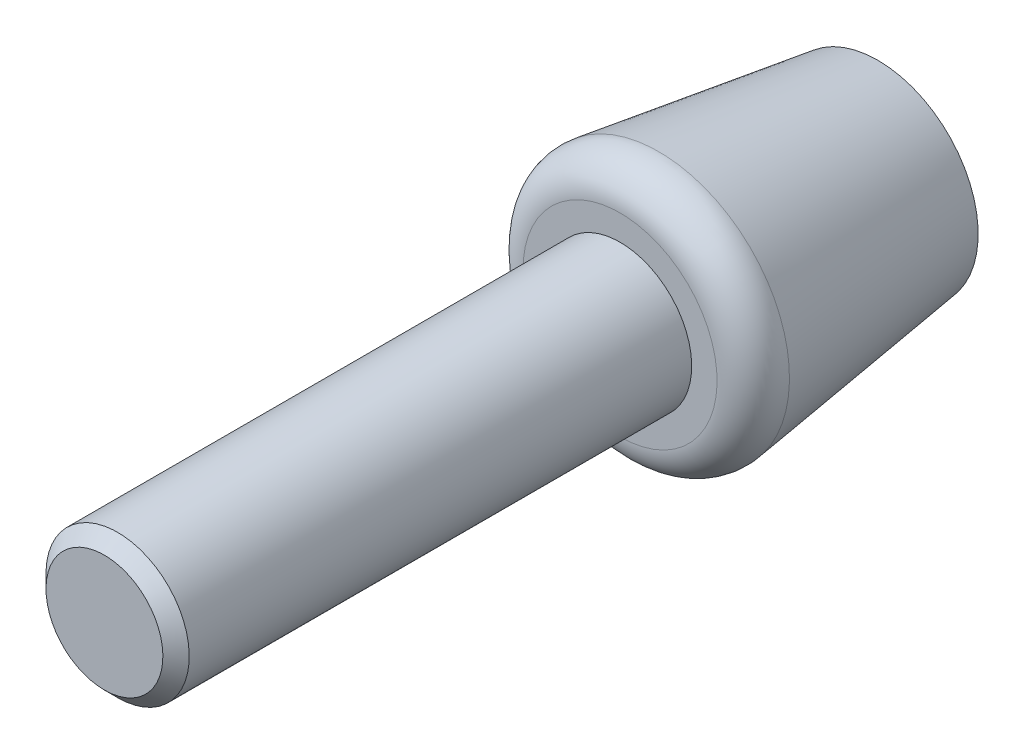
ISO-10303-21;
HEADER;
FILE_DESCRIPTION(('STEP AP214'),'2;1');
FILE_NAME('part.step','',(''),(''),'','','');
FILE_SCHEMA(('AUTOMOTIVE_DESIGN { 1 0 10303 214 1 1 1 1 }'));
ENDSEC;
DATA;
#1=APPLICATION_CONTEXT('core data for automotive mechanical design processes');
#2=APPLICATION_PROTOCOL_DEFINITION('international standard','automotive_design',2000,#1);
#3=PRODUCT_CONTEXT('',#1,'mechanical');
#4=PRODUCT('Part','Part','',(#3));
#5=PRODUCT_RELATED_PRODUCT_CATEGORY('part','',(#4));
#6=PRODUCT_DEFINITION_FORMATION('','',#4);
#7=PRODUCT_DEFINITION_CONTEXT('part definition',#1,'design');
#8=PRODUCT_DEFINITION('design','',#6,#7);
#9=PRODUCT_DEFINITION_SHAPE('','',#8);
#10=(LENGTH_UNIT() NAMED_UNIT(*) SI_UNIT(.MILLI.,.METRE.));
#11=(NAMED_UNIT(*) PLANE_ANGLE_UNIT() SI_UNIT($,.RADIAN.));
#12=(NAMED_UNIT(*) SI_UNIT($,.STERADIAN.) SOLID_ANGLE_UNIT());
#13=UNCERTAINTY_MEASURE_WITH_UNIT(LENGTH_MEASURE(1.E-05),#10,'distance_accuracy_value','');
#14=(GEOMETRIC_REPRESENTATION_CONTEXT(3) GLOBAL_UNCERTAINTY_ASSIGNED_CONTEXT((#13)) GLOBAL_UNIT_ASSIGNED_CONTEXT((#10,
#11,#12)) REPRESENTATION_CONTEXT('',''));
#15=CARTESIAN_POINT('',(0.,0.,0.));
#16=DIRECTION('',(0.,0.,1.));
#17=DIRECTION('',(1.,0.,0.));
#18=AXIS2_PLACEMENT_3D('',#15,#16,#17);
#19=CARTESIAN_POINT('',(0.,0.,54.));
#20=DIRECTION('',(0.,0.,1.));
#21=DIRECTION('',(0.,-1.,0.));
#22=AXIS2_PLACEMENT_3D('',#19,#20,#21);
#23=PLANE('',#22);
#24=CARTESIAN_POINT('',(0.,0.,54.));
#25=DIRECTION('',(0.,0.,1.));
#26=DIRECTION('',(0.,-1.,0.));
#27=AXIS2_PLACEMENT_3D('',#24,#25,#26);
#28=CIRCLE('',#27,4.08);
#29=CARTESIAN_POINT('',(0.,-4.08,54.));
#30=VERTEX_POINT('',#29);
#31=EDGE_CURVE('E8',#30,#30,#28,.T.);
#32=ORIENTED_EDGE('',*,*,#31,.T.);
#33=EDGE_LOOP('',(#32));
#34=FACE_BOUND('',#33,.T.);
#35=ADVANCED_FACE('F13',(#34),#23,.T.);
#36=CARTESIAN_POINT('',(0.,0.,54.));
#37=DIRECTION('',(0.,0.,-1.));
#38=DIRECTION('',(0.,1.,0.));
#39=AXIS2_PLACEMENT_3D('',#36,#37,#38);
#40=CONICAL_SURFACE('',#39,4.08,0.785398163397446);
#41=CARTESIAN_POINT('',(0.,0.,53.08));
#42=DIRECTION('',(0.,0.,1.));
#43=DIRECTION('',(0.,-1.,0.));
#44=AXIS2_PLACEMENT_3D('',#41,#42,#43);
#45=CIRCLE('',#44,5.);
#46=CARTESIAN_POINT('',(0.,-5.,53.08));
#47=VERTEX_POINT('',#46);
#48=EDGE_CURVE('E19',#47,#47,#45,.T.);
#49=ORIENTED_EDGE('',*,*,#48,.T.);
#50=EDGE_LOOP('',(#49));
#51=FACE_BOUND('',#50,.T.);
#52=ORIENTED_EDGE('',*,*,#31,.F.);
#53=EDGE_LOOP('',(#52));
#54=FACE_BOUND('',#53,.T.);
#55=ADVANCED_FACE('F53',(#51,#54),#40,.T.);
#56=CARTESIAN_POINT('',(0.,0.,0.));
#57=DIRECTION('',(0.,0.,1.));
#58=DIRECTION('',(0.,-1.,0.));
#59=AXIS2_PLACEMENT_3D('',#56,#57,#58);
#60=CYLINDRICAL_SURFACE('',#59,5.);
#61=CARTESIAN_POINT('',(0.,0.,18.));
#62=DIRECTION('',(0.,0.,1.));
#63=DIRECTION('',(0.,-1.,0.));
#64=AXIS2_PLACEMENT_3D('',#61,#62,#63);
#65=CIRCLE('',#64,5.);
#66=CARTESIAN_POINT('',(0.,-5.,18.));
#67=VERTEX_POINT('',#66);
#68=EDGE_CURVE('E23',#67,#67,#65,.T.);
#69=ORIENTED_EDGE('',*,*,#68,.T.);
#70=EDGE_LOOP('',(#69));
#71=FACE_BOUND('',#70,.T.);
#72=ORIENTED_EDGE('',*,*,#48,.F.);
#73=EDGE_LOOP('',(#72));
#74=FACE_BOUND('',#73,.T.);
#75=ADVANCED_FACE('F58',(#71,#74),#60,.T.);
#76=CARTESIAN_POINT('',(5.,0.,18.));
#77=DIRECTION('',(0.,0.,1.));
#78=DIRECTION('',(0.,-1.,0.));
#79=AXIS2_PLACEMENT_3D('',#76,#77,#78);
#80=PLANE('',#79);
#81=CARTESIAN_POINT('',(0.,0.,18.));
#82=DIRECTION('',(0.,0.,1.));
#83=DIRECTION('',(0.,-1.,0.));
#84=AXIS2_PLACEMENT_3D('',#81,#82,#83);
#85=CIRCLE('',#84,6.7723412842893);
#86=CARTESIAN_POINT('',(0.,-6.7723412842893,18.));
#87=VERTEX_POINT('',#86);
#88=EDGE_CURVE('E27',#87,#87,#85,.T.);
#89=ORIENTED_EDGE('',*,*,#88,.T.);
#90=EDGE_LOOP('',(#89));
#91=FACE_BOUND('',#90,.T.);
#92=ORIENTED_EDGE('',*,*,#68,.F.);
#93=EDGE_LOOP('',(#92));
#94=FACE_BOUND('',#93,.T.);
#95=ADVANCED_FACE('F63',(#91,#94),#80,.T.);
#96=CARTESIAN_POINT('',(0.,0.,15.625));
#97=DIRECTION('',(0.,0.,1.));
#98=DIRECTION('',(0.,-1.,0.));
#99=AXIS2_PLACEMENT_3D('',#96,#97,#98);
#100=TOROIDAL_SURFACE('',#99,6.77234128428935,2.375);
#101=CARTESIAN_POINT('',(0.,0.,15.2982751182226));
#102=DIRECTION('',(0.,0.,1.));
#103=DIRECTION('',(0.,-1.,0.));
#104=AXIS2_PLACEMENT_3D('',#101,#102,#103);
#105=CIRCLE('',#104,9.1247604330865);
#106=CARTESIAN_POINT('',(0.,-9.1247604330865,15.2982751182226));
#107=VERTEX_POINT('',#106);
#108=EDGE_CURVE('E32',#107,#107,#105,.T.);
#109=ORIENTED_EDGE('',*,*,#108,.T.);
#110=EDGE_LOOP('',(#109));
#111=FACE_BOUND('',#110,.T.);
#112=ORIENTED_EDGE('',*,*,#88,.F.);
#113=EDGE_LOOP('',(#112));
#114=FACE_BOUND('',#113,.T.);
#115=ADVANCED_FACE('F50',(#111,#114),#100,.T.);
#116=CARTESIAN_POINT('',(0.,0.,15.2982751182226));
#117=DIRECTION('',(0.,0.,1.));
#118=DIRECTION('',(0.,-1.,0.));
#119=AXIS2_PLACEMENT_3D('',#116,#117,#118);
#120=CONICAL_SURFACE('',#119,9.1247604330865,0.138006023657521);
#121=CARTESIAN_POINT('',(0.,0.,0.));
#122=DIRECTION('',(0.,0.,1.));
#123=DIRECTION('',(0.,-1.,0.));
#124=AXIS2_PLACEMENT_3D('',#121,#122,#123);
#125=CIRCLE('',#124,7.);
#126=CARTESIAN_POINT('',(0.,-7.,0.));
#127=VERTEX_POINT('',#126);
#128=EDGE_CURVE('E35',#127,#127,#125,.T.);
#129=ORIENTED_EDGE('',*,*,#128,.T.);
#130=EDGE_LOOP('',(#129));
#131=FACE_BOUND('',#130,.T.);
#132=ORIENTED_EDGE('',*,*,#108,.F.);
#133=EDGE_LOOP('',(#132));
#134=FACE_BOUND('',#133,.T.);
#135=ADVANCED_FACE('F39',(#131,#134),#120,.T.);
#136=CARTESIAN_POINT('',(7.,0.,0.));
#137=DIRECTION('',(0.,0.,-1.));
#138=DIRECTION('',(0.,1.,0.));
#139=AXIS2_PLACEMENT_3D('',#136,#137,#138);
#140=PLANE('',#139);
#141=ORIENTED_EDGE('',*,*,#128,.F.);
#142=EDGE_LOOP('',(#141));
#143=FACE_BOUND('',#142,.T.);
#144=ADVANCED_FACE('F42',(#143),#140,.T.);
#145=CLOSED_SHELL('',(#35,#55,#75,#95,#115,#135,#144));
#146=MANIFOLD_SOLID_BREP('B1',#145);
#147=ADVANCED_BREP_SHAPE_REPRESENTATION('',(#18,#146),#14);
#148=SHAPE_DEFINITION_REPRESENTATION(#9,#147);
ENDSEC;
END-ISO-10303-21;
